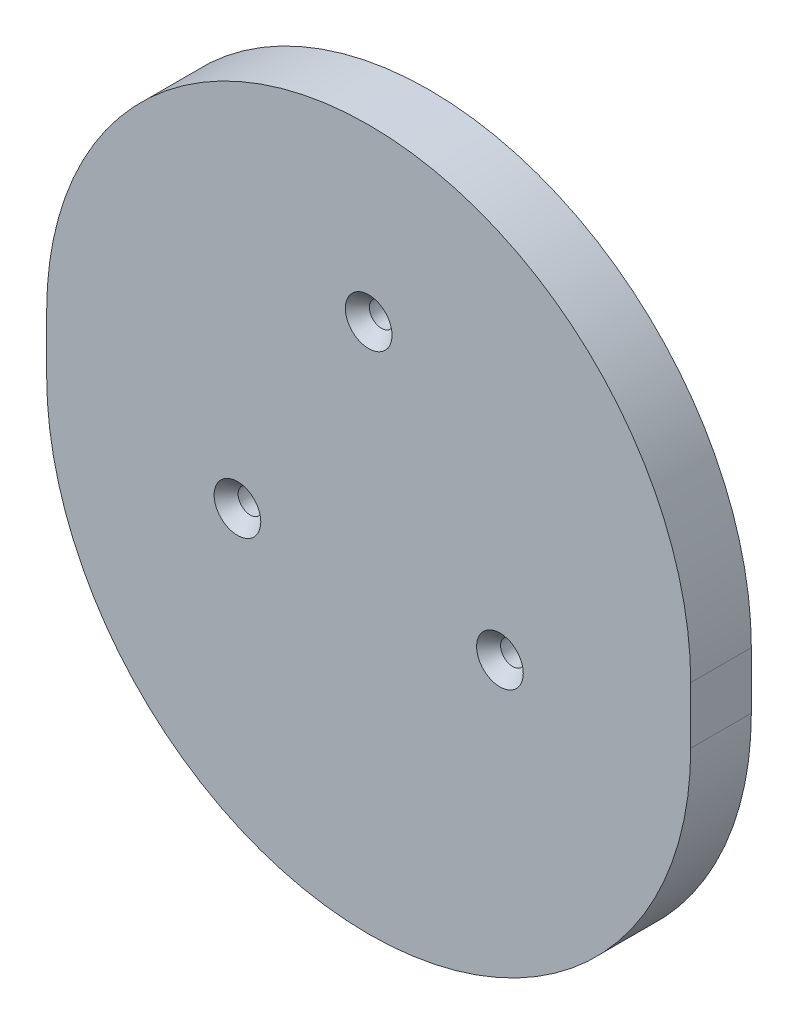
from build123d import *

# Parameters (mm, degrees)
BOSS_EXTRUDE1_DEPTH                             = 12.7
F_10_32_TAPPED_HOLE1_D                          = 4.0386
F_10_32_TAPPED_HOLE1_DEPTH                      = 12.0396
F_10_32_TAPPED_HOLE1_TIP                        = 1.213317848
F_10_32_TAPPED_HOLE2_D                          = 4.0386
F_10_32_TAPPED_HOLE2_DEPTH                      = 12.0396
F_10_32_TAPPED_HOLE2_TIP                        = 1.213317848
CSK_FOR_10_FLAT_HEAD_MACHINE_SCREW1_D           = 5.1054
CSK_FOR_10_FLAT_HEAD_MACHINE_SCREW1_CSINK_D     = 9.779
CSK_FOR_10_FLAT_HEAD_MACHINE_SCREW1_CSINK_ANGLE = 82
PAR_CUT_EXTRUDE5_DEPTH                          = 145.746383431
PAR_CUT_EXTRUDE5_DEPTH_BACK                     = 145.746383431
SKETCH19_W                                      = 9.525
SKETCH19_H                                      = 20.6375
SKETCH18_OUTSIDE_W                              = 257.848
SKETCH18_OUTSIDE_H                              = 269.282
CUT_EXTRUDE4_DEPTH                              = 145.746383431


with BuildPart() as part:
    # Sketch2 → Boss-Extrude1 (new body)
    with BuildSketch(Plane.XY):
        with BuildLine():
            Line((-82.423, 34.1376), (-99.057684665, 34.1376))
            ThreePointArc((-99.057684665, 34.1376), (0, 104.775), (99.057684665, 34.1376))
            Line((99.057684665, 34.1376), (82.423, 34.1376))
            Line((82.423, 34.1376), (82.423, 14.2748))
            ThreePointArc((82.423, 14.2748), (68.1355, -0.0127), (82.423, -14.3002))
            Line((82.423, -14.3002), (82.423, -48.4124))
            Line((82.423, -48.4124), (92.919535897, -48.4124))
            ThreePointArc((92.919535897, -48.4124), (0, -104.775), (-92.919535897, -48.4124))
            Line((-92.919535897, -48.4124), (-82.423, -48.4124))
            Line((-82.423, -48.4124), (-82.423, 34.1376))
        make_face()
    extrude(amount=-BOSS_EXTRUDE1_DEPTH)

    # 10-32 Tapped Hole1
    with Locations(Plane(origin=(82.423, 0, 0), x_dir=(0, 0, -1), z_dir=(1, 0, 0))):
        with Locations((6.35, 24.6126), (6.35, -38.8874)):
            Hole(F_10_32_TAPPED_HOLE1_D / 2, depth=F_10_32_TAPPED_HOLE1_DEPTH)
            with Locations((0, 0, -(F_10_32_TAPPED_HOLE1_DEPTH + F_10_32_TAPPED_HOLE1_TIP / 2))):  # 118° drill point
                Cone(0, F_10_32_TAPPED_HOLE1_D / 2, F_10_32_TAPPED_HOLE1_TIP, mode=Mode.SUBTRACT)

    # 10-32 Tapped Hole2
    with Locations(Plane.ZY.offset(82.423)):
        with Locations((-6.35, -38.8874), (-6.35, 24.6126)):
            Hole(F_10_32_TAPPED_HOLE2_D / 2, depth=F_10_32_TAPPED_HOLE2_DEPTH)
            with Locations((0, 0, -(F_10_32_TAPPED_HOLE2_DEPTH + F_10_32_TAPPED_HOLE2_TIP / 2))):  # 118° drill point
                Cone(0, F_10_32_TAPPED_HOLE2_D / 2, F_10_32_TAPPED_HOLE2_TIP, mode=Mode.SUBTRACT)

    # CSK for _10 Flat Head Machine Screw1 (through all)
    with Locations(Plane(origin=(82.423, 26.8097, 0), x_dir=(1, 0, 0), z_dir=(0, 0, 1))):
        with Locations((-82.423, 4.9403), (-54.92669343, -42.6847), (-109.91930657, -42.6847)):
            CounterSinkHole(CSK_FOR_10_FLAT_HEAD_MACHINE_SCREW1_D / 2, CSK_FOR_10_FLAT_HEAD_MACHINE_SCREW1_CSINK_D / 2, counter_sink_angle=CSK_FOR_10_FLAT_HEAD_MACHINE_SCREW1_CSINK_ANGLE)

    # Sketch19 → PAR Cut-Extrude5 (cut, two sides: drawn at the far end of the back side and taken through both)
    with BuildSketch(Plane(origin=(0, 0, 0), x_dir=(0, 0, -1), z_dir=(1, 0, 0)).offset(-PAR_CUT_EXTRUDE5_DEPTH_BACK)):
        with Locations((7.9375, 94.45625)):
            Rectangle(SKETCH19_W, SKETCH19_H)
    extrude(amount=PAR_CUT_EXTRUDE5_DEPTH + PAR_CUT_EXTRUDE5_DEPTH_BACK, mode=Mode.SUBTRACT)

    # Sketch18 outside → Cut-Extrude4 (cut, through all)
    with BuildSketch(Plane.XY):
        Rectangle(SKETCH18_OUTSIDE_W, SKETCH18_OUTSIDE_H)
        with BuildLine():
            Line((67.46875, 0), (67.46875, -11.90625))
            ThreePointArc((67.46875, -11.90625), (0, -79.375), (-67.46875, -11.90625))
            Line((-67.46875, -11.90625), (-67.46875, 0))
            ThreePointArc((-67.46875, 0), (0, 67.46875), (67.46875, 0))
        make_face(mode=Mode.SUBTRACT)
    extrude(amount=-CUT_EXTRUDE4_DEPTH, mode=Mode.SUBTRACT)


solid = part.part
